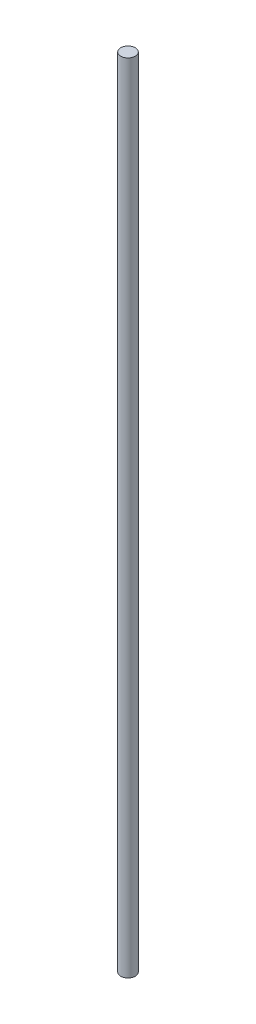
from build123d import *

# Parameters (mm, degrees)
SKETCH1_R          = 1.397
BASE_EXTRUDE_DEPTH = 76.2


with BuildPart() as part:
    # Sketch1 → Base-Extrude (new, symmetric)
    with BuildSketch(Plane(origin=(0, 0, 0), x_dir=(1, 0, 0), z_dir=(0, 1, 0))):
        with Locations(Location((0, 0, 0), (0, 0, 90))):
            Circle(SKETCH1_R)
    extrude(amount=BASE_EXTRUDE_DEPTH, both=True)


solid = part.part
